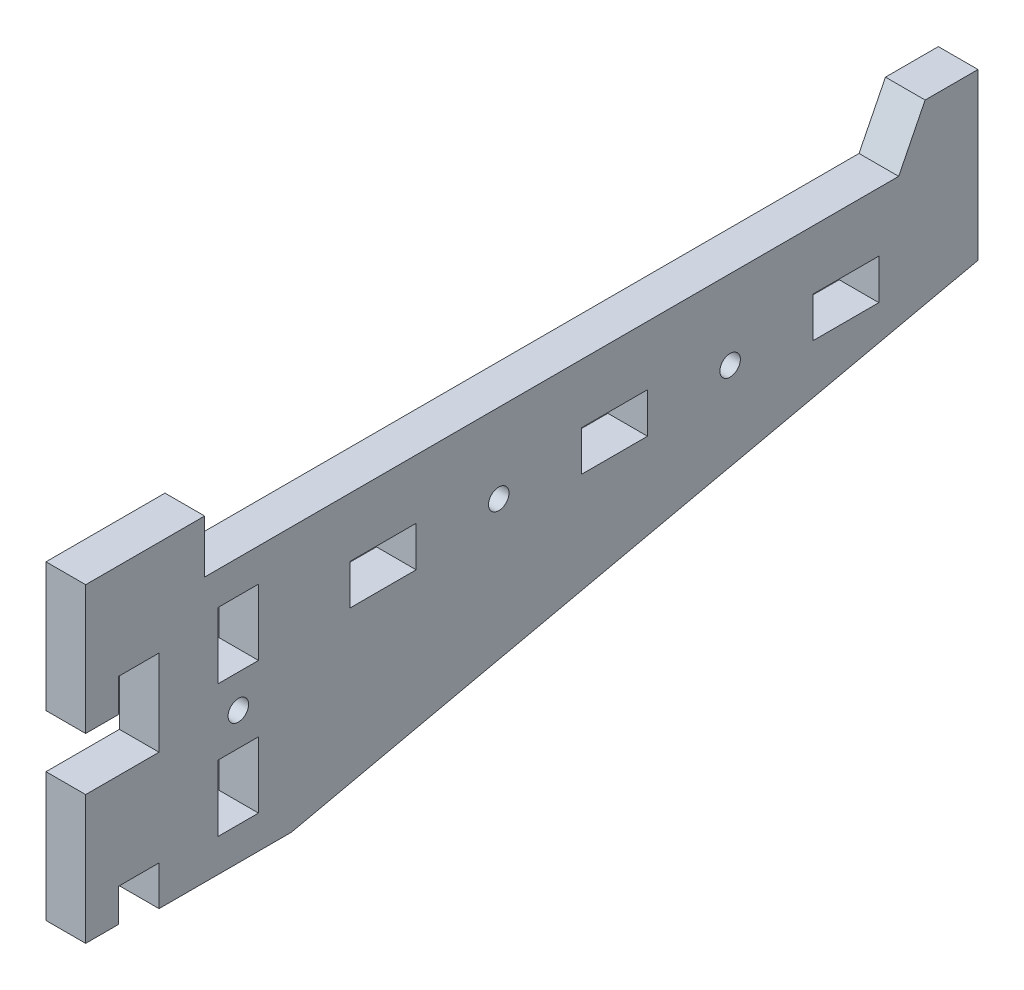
from build123d import *

# Parameters (mm, degrees)
EXTRUDE_1_DEPTH     = 6
SKETCH_2_R          = 1.55
SKETCH_2_W          = 6.1
SKETCH_2_H          = 10
CUT_EXTRUDE_1_DEPTH = 131.334991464
SKETCH_3_R          = 1.55
SKETCH_3_W          = 10
SKETCH_3_H          = 6.1
CUT_EXTRUDE_2_DEPTH = 131.334991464


with BuildPart() as part:
    # Sketch 1 → Extrude 1 (new body)
    with BuildSketch(Plane(origin=(0, 0, 0), x_dir=(0, 0, -1), z_dir=(1, 0, 0))):
        Polygon((111.9, 0), (115.9, 8), (123.9, 8), (123.9, -17), (20, -40), (0, -40), (0, -34), (-6.1, -34), (-6.1, -39), (-11.1, -39), (-11.1, -19.5), (0, -19.5), (0, -6.5), (-6.1, -6.5), (-6.1, -11.5), (-11.1, -11.5), (-11.1, 8), (6.9, 8), (6.9, 0), align=None)
    extrude(amount=EXTRUDE_1_DEPTH)

    # Sketch 2 → Cut-Extrude 1 (cut, through all)
    with BuildSketch(Plane(origin=(6, 0, 0), x_dir=(0, 0, -1), z_dir=(1, 0, 0))):
        with Locations((12, -20)):
            Circle(SKETCH_2_R)
        with Locations((12, -10)):
            Rectangle(SKETCH_2_W, SKETCH_2_H)
        with Locations((12, -30)):
            Rectangle(SKETCH_2_W, SKETCH_2_H)
    extrude(amount=-CUT_EXTRUDE_1_DEPTH, mode=Mode.SUBTRACT)

    # Sketch 3 → Cut-Extrude 2 (cut, through all)
    with BuildSketch(Plane(origin=(6, 0, 0), x_dir=(0, 0, -1), z_dir=(1, 0, 0))):
        with Locations((51.4, -12)):
            Circle(SKETCH_3_R)
        with Locations((86.4, -12)):
            Circle(SKETCH_3_R)
        with Locations((33.9, -12)):
            Rectangle(SKETCH_3_W, SKETCH_3_H)
        with Locations((68.9, -12)):
            Rectangle(SKETCH_3_W, SKETCH_3_H)
        with Locations((103.9, -12)):
            Rectangle(SKETCH_3_W, SKETCH_3_H)
    extrude(amount=-CUT_EXTRUDE_2_DEPTH, mode=Mode.SUBTRACT)


solid = part.part
